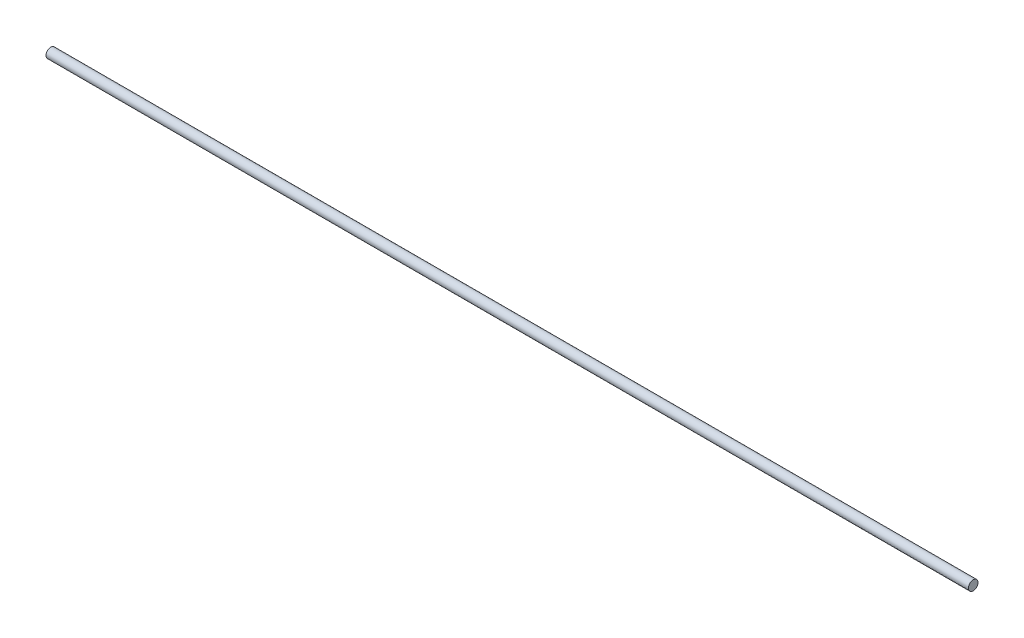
ISO-10303-21;
HEADER;
FILE_DESCRIPTION(('STEP AP214'),'2;1');
FILE_NAME('part.step','',(''),(''),'','','');
FILE_SCHEMA(('AUTOMOTIVE_DESIGN { 1 0 10303 214 1 1 1 1 }'));
ENDSEC;
DATA;
#1=APPLICATION_CONTEXT('core data for automotive mechanical design processes');
#2=APPLICATION_PROTOCOL_DEFINITION('international standard','automotive_design',2000,#1);
#3=PRODUCT_CONTEXT('',#1,'mechanical');
#4=PRODUCT('Part','Part','',(#3));
#5=PRODUCT_RELATED_PRODUCT_CATEGORY('part','',(#4));
#6=PRODUCT_DEFINITION_FORMATION('','',#4);
#7=PRODUCT_DEFINITION_CONTEXT('part definition',#1,'design');
#8=PRODUCT_DEFINITION('design','',#6,#7);
#9=PRODUCT_DEFINITION_SHAPE('','',#8);
#10=(LENGTH_UNIT() NAMED_UNIT(*) SI_UNIT(.MILLI.,.METRE.));
#11=(NAMED_UNIT(*) PLANE_ANGLE_UNIT() SI_UNIT($,.RADIAN.));
#12=(NAMED_UNIT(*) SI_UNIT($,.STERADIAN.) SOLID_ANGLE_UNIT());
#13=UNCERTAINTY_MEASURE_WITH_UNIT(LENGTH_MEASURE(1.E-05),#10,'distance_accuracy_value','');
#14=(GEOMETRIC_REPRESENTATION_CONTEXT(3) GLOBAL_UNCERTAINTY_ASSIGNED_CONTEXT((#13)) GLOBAL_UNIT_ASSIGNED_CONTEXT((#10,
#11,#12)) REPRESENTATION_CONTEXT('',''));
#15=CARTESIAN_POINT('',(0.,0.,0.));
#16=DIRECTION('',(0.,0.,1.));
#17=DIRECTION('',(1.,0.,0.));
#18=AXIS2_PLACEMENT_3D('',#15,#16,#17);
#19=CARTESIAN_POINT('',(1219.2,0.,0.));
#20=DIRECTION('',(-1.,0.,0.));
#21=DIRECTION('',(0.,0.,1.));
#22=AXIS2_PLACEMENT_3D('',#19,#20,#21);
#23=CYLINDRICAL_SURFACE('',#22,6.35);
#24=CARTESIAN_POINT('',(1219.2,0.,0.));
#25=DIRECTION('',(1.,0.,0.));
#26=DIRECTION('',(0.,0.,-1.));
#27=AXIS2_PLACEMENT_3D('',#24,#25,#26);
#28=CIRCLE('',#27,6.35);
#29=CARTESIAN_POINT('',(1219.2,0.,6.35));
#30=VERTEX_POINT('',#29);
#31=EDGE_CURVE('E10',#30,#30,#28,.T.);
#32=CARTESIAN_POINT('',(0.,0.,0.));
#33=DIRECTION('',(1.,0.,0.));
#34=DIRECTION('',(0.,0.,-1.));
#35=AXIS2_PLACEMENT_3D('',#32,#33,#34);
#36=CIRCLE('',#35,6.35);
#37=CARTESIAN_POINT('',(0.,0.,6.35));
#38=VERTEX_POINT('',#37);
#39=EDGE_CURVE('E34',#38,#38,#36,.T.);
#40=CARTESIAN_POINT('',(1219.2,0.,6.35));
#41=CARTESIAN_POINT('',(1206.5,0.,6.35));
#42=CARTESIAN_POINT('',(1193.8,0.,6.35));
#43=CARTESIAN_POINT('',(1168.4,0.,6.35));
#44=CARTESIAN_POINT('',(1155.7,0.,6.35));
#45=CARTESIAN_POINT('',(1130.3,0.,6.35));
#46=CARTESIAN_POINT('',(1117.6,0.,6.35));
#47=CARTESIAN_POINT('',(1092.2,0.,6.35));
#48=CARTESIAN_POINT('',(1079.5,0.,6.35));
#49=CARTESIAN_POINT('',(1054.1,0.,6.35));
#50=CARTESIAN_POINT('',(1041.4,0.,6.35));
#51=CARTESIAN_POINT('',(1016.,0.,6.35));
#52=CARTESIAN_POINT('',(1003.3,0.,6.35));
#53=CARTESIAN_POINT('',(977.9,0.,6.35));
#54=CARTESIAN_POINT('',(965.2,0.,6.35));
#55=CARTESIAN_POINT('',(939.8,0.,6.35));
#56=CARTESIAN_POINT('',(927.1,0.,6.35));
#57=CARTESIAN_POINT('',(901.7,0.,6.35));
#58=CARTESIAN_POINT('',(889.,0.,6.35));
#59=CARTESIAN_POINT('',(863.6,0.,6.35));
#60=CARTESIAN_POINT('',(850.9,0.,6.35));
#61=CARTESIAN_POINT('',(825.5,0.,6.35));
#62=CARTESIAN_POINT('',(812.8,0.,6.35));
#63=CARTESIAN_POINT('',(787.4,0.,6.35));
#64=CARTESIAN_POINT('',(774.7,0.,6.35));
#65=CARTESIAN_POINT('',(749.3,0.,6.35));
#66=CARTESIAN_POINT('',(736.6,0.,6.35));
#67=CARTESIAN_POINT('',(711.2,0.,6.35));
#68=CARTESIAN_POINT('',(698.5,0.,6.35));
#69=CARTESIAN_POINT('',(673.1,0.,6.35));
#70=CARTESIAN_POINT('',(660.4,0.,6.35));
#71=CARTESIAN_POINT('',(635.,0.,6.35));
#72=CARTESIAN_POINT('',(622.3,0.,6.35));
#73=CARTESIAN_POINT('',(596.9,0.,6.35));
#74=CARTESIAN_POINT('',(584.2,0.,6.35));
#75=CARTESIAN_POINT('',(558.8,0.,6.35));
#76=CARTESIAN_POINT('',(546.1,0.,6.35));
#77=CARTESIAN_POINT('',(520.7,0.,6.35));
#78=CARTESIAN_POINT('',(508.,0.,6.35));
#79=CARTESIAN_POINT('',(482.6,0.,6.35));
#80=CARTESIAN_POINT('',(469.9,0.,6.35));
#81=CARTESIAN_POINT('',(444.5,0.,6.35));
#82=CARTESIAN_POINT('',(431.8,0.,6.35));
#83=CARTESIAN_POINT('',(406.4,0.,6.35));
#84=CARTESIAN_POINT('',(393.7,0.,6.35));
#85=CARTESIAN_POINT('',(368.3,0.,6.35));
#86=CARTESIAN_POINT('',(355.6,0.,6.35));
#87=CARTESIAN_POINT('',(330.2,0.,6.35));
#88=CARTESIAN_POINT('',(317.5,0.,6.35));
#89=CARTESIAN_POINT('',(292.1,0.,6.35));
#90=CARTESIAN_POINT('',(279.4,0.,6.35));
#91=CARTESIAN_POINT('',(254.,0.,6.35));
#92=CARTESIAN_POINT('',(241.3,0.,6.35));
#93=CARTESIAN_POINT('',(215.9,0.,6.35));
#94=CARTESIAN_POINT('',(203.2,0.,6.35));
#95=CARTESIAN_POINT('',(177.8,0.,6.35));
#96=CARTESIAN_POINT('',(165.1,0.,6.35));
#97=CARTESIAN_POINT('',(139.7,0.,6.35));
#98=CARTESIAN_POINT('',(127.,0.,6.35));
#99=CARTESIAN_POINT('',(101.6,0.,6.35));
#100=CARTESIAN_POINT('',(88.9,0.,6.35));
#101=CARTESIAN_POINT('',(63.5,0.,6.35));
#102=CARTESIAN_POINT('',(50.8,0.,6.35));
#103=CARTESIAN_POINT('',(25.4,0.,6.35));
#104=CARTESIAN_POINT('',(12.7,0.,6.35));
#105=CARTESIAN_POINT('',(0.,0.,6.35));
#106=B_SPLINE_CURVE_WITH_KNOTS('',3,(#40,#41,#42,#43,#44,#45,#46,#47,#48,#49,#50,#51,#52,#53,
#54,#55,#56,#57,#58,#59,#60,#61,#62,#63,#64,#65,#66,#67,#68,#69,#70,#71,#72,#73,#74,#75,#76,#77,
#78,#79,#80,#81,#82,#83,#84,#85,#86,#87,#88,#89,#90,#91,#92,#93,#94,#95,#96,#97,#98,#99,#100,
#101,#102,#103,#104,#105),.UNSPECIFIED.,.F.,.F.,(4,2,2,2,2,2,2,2,2,2,2,2,2,2,2,2,2,2,2,2,2,2,2,
2,2,2,2,2,2,2,2,2,4),(0.,38.1,76.2,114.3,152.4,190.5,228.6,266.7,304.8,342.9,381.,419.1,457.2,
495.3,533.4,571.5,609.6,647.7,685.8,723.9,762.,800.1,838.2,876.3,914.4,952.5,990.6,1028.7,
1066.8,1104.9,1143.,1181.1,1219.2),.UNSPECIFIED.);
#107=EDGE_CURVE('BSEAM31',#30,#38,#106,.T.);
#108=ORIENTED_EDGE('',*,*,#31,.F.);
#109=ORIENTED_EDGE('',*,*,#39,.T.);
#110=ORIENTED_EDGE('',*,*,#107,.T.);
#111=ORIENTED_EDGE('',*,*,#107,.F.);
#112=EDGE_LOOP('',(#108,#110,#109,#111));
#113=FACE_BOUND('',#112,.T.);
#114=ADVANCED_FACE('F31',(#113),#23,.T.);
#115=CARTESIAN_POINT('',(1219.2,0.,0.));
#116=DIRECTION('',(1.,0.,0.));
#117=DIRECTION('',(0.,0.,-1.));
#118=AXIS2_PLACEMENT_3D('',#115,#116,#117);
#119=PLANE('',#118);
#120=ORIENTED_EDGE('',*,*,#31,.T.);
#121=EDGE_LOOP('',(#120));
#122=FACE_BOUND('',#121,.T.);
#123=ADVANCED_FACE('F46',(#122),#119,.T.);
#124=CARTESIAN_POINT('',(0.,0.,0.));
#125=DIRECTION('',(1.,0.,0.));
#126=DIRECTION('',(0.,0.,-1.));
#127=AXIS2_PLACEMENT_3D('',#124,#125,#126);
#128=PLANE('',#127);
#129=ORIENTED_EDGE('',*,*,#39,.F.);
#130=EDGE_LOOP('',(#129));
#131=FACE_BOUND('',#130,.T.);
#132=ADVANCED_FACE('F44',(#131),#128,.F.);
#133=CLOSED_SHELL('',(#114,#123,#132));
#134=MANIFOLD_SOLID_BREP('B2',#133);
#135=ADVANCED_BREP_SHAPE_REPRESENTATION('',(#18,#134),#14);
#136=SHAPE_DEFINITION_REPRESENTATION(#9,#135);
ENDSEC;
END-ISO-10303-21;
